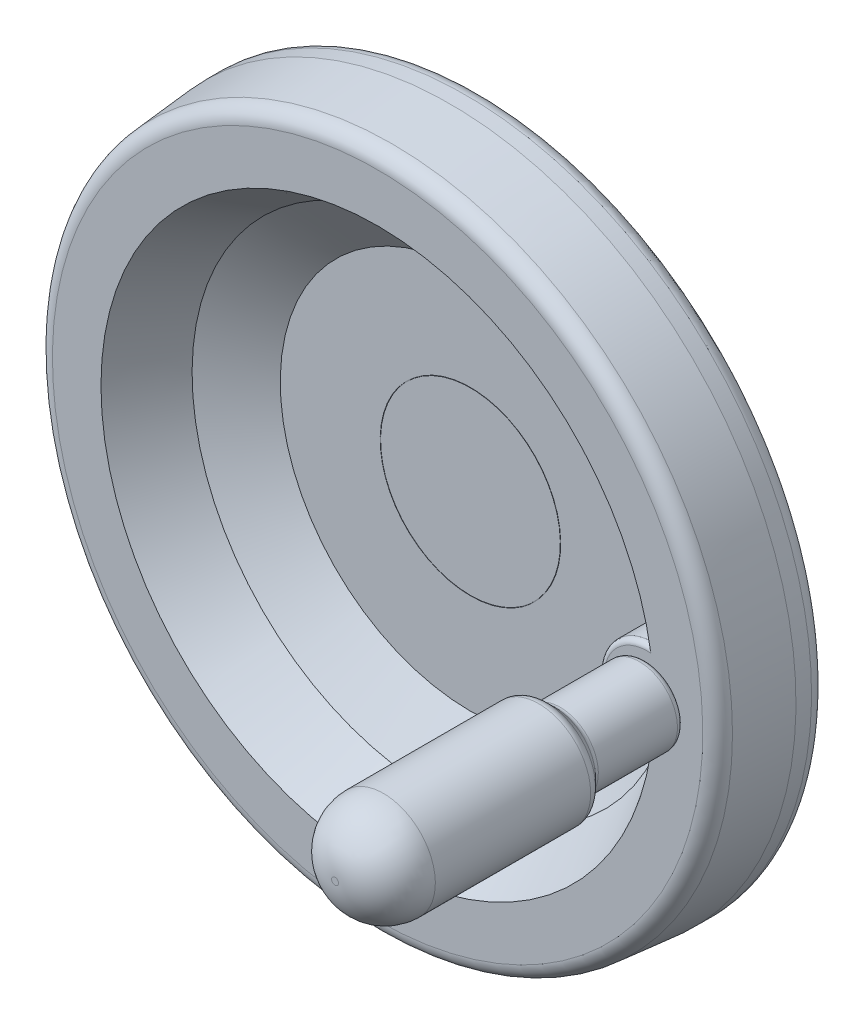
ISO-10303-21;
HEADER;
FILE_DESCRIPTION(('STEP AP214'),'2;1');
FILE_NAME('part.step','',(''),(''),'','','');
FILE_SCHEMA(('AUTOMOTIVE_DESIGN { 1 0 10303 214 1 1 1 1 }'));
ENDSEC;
DATA;
#1=APPLICATION_CONTEXT('core data for automotive mechanical design processes');
#2=APPLICATION_PROTOCOL_DEFINITION('international standard','automotive_design',2000,#1);
#3=PRODUCT_CONTEXT('',#1,'mechanical');
#4=PRODUCT('Part','Part','',(#3));
#5=PRODUCT_RELATED_PRODUCT_CATEGORY('part','',(#4));
#6=PRODUCT_DEFINITION_FORMATION('','',#4);
#7=PRODUCT_DEFINITION_CONTEXT('part definition',#1,'design');
#8=PRODUCT_DEFINITION('design','',#6,#7);
#9=PRODUCT_DEFINITION_SHAPE('','',#8);
#10=(LENGTH_UNIT() NAMED_UNIT(*) SI_UNIT(.MILLI.,.METRE.));
#11=(NAMED_UNIT(*) PLANE_ANGLE_UNIT() SI_UNIT($,.RADIAN.));
#12=(NAMED_UNIT(*) SI_UNIT($,.STERADIAN.) SOLID_ANGLE_UNIT());
#13=UNCERTAINTY_MEASURE_WITH_UNIT(LENGTH_MEASURE(1.E-05),#10,'distance_accuracy_value','');
#14=(GEOMETRIC_REPRESENTATION_CONTEXT(3) GLOBAL_UNCERTAINTY_ASSIGNED_CONTEXT((#13)) GLOBAL_UNIT_ASSIGNED_CONTEXT((#10,
#11,#12)) REPRESENTATION_CONTEXT('',''));
#15=CARTESIAN_POINT('',(0.,0.,0.));
#16=DIRECTION('',(0.,0.,1.));
#17=DIRECTION('',(1.,0.,0.));
#18=AXIS2_PLACEMENT_3D('',#15,#16,#17);
#19=CARTESIAN_POINT('',(80.,0.,68.));
#20=DIRECTION('',(0.,0.,-1.));
#21=DIRECTION('',(0.,1.,0.));
#22=AXIS2_PLACEMENT_3D('',#19,#20,#21);
#23=PLANE('',#22);
#24=CARTESIAN_POINT('',(0.,0.,68.));
#25=DIRECTION('',(0.,0.,1.));
#26=DIRECTION('',(0.,-1.,0.));
#27=AXIS2_PLACEMENT_3D('',#24,#25,#26);
#28=CIRCLE('',#27,94.039247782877);
#29=CARTESIAN_POINT('',(0.,-94.039247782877,68.));
#30=VERTEX_POINT('',#29);
#31=EDGE_CURVE('E54',#30,#30,#28,.T.);
#32=ORIENTED_EDGE('',*,*,#31,.T.);
#33=EDGE_LOOP('',(#32));
#34=FACE_BOUND('',#33,.T.);
#35=CARTESIAN_POINT('',(0.,0.,68.));
#36=DIRECTION('',(0.,0.,1.));
#37=DIRECTION('',(0.,-1.,0.));
#38=AXIS2_PLACEMENT_3D('',#35,#36,#37);
#39=CIRCLE('',#38,80.);
#40=CARTESIAN_POINT('',(79.0240384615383,12.4579831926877,68.));
#41=VERTEX_POINT('',#40);
#42=CARTESIAN_POINT('',(79.0240384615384,-12.4579831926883,68.));
#43=VERTEX_POINT('',#42);
#44=EDGE_CURVE('E49',#41,#43,#39,.T.);
#45=ORIENTED_EDGE('',*,*,#44,.F.);
#46=CARTESIAN_POINT('',(78.,0.,68.));
#47=DIRECTION('',(0.,0.,-1.));
#48=DIRECTION('',(0.,1.,0.));
#49=AXIS2_PLACEMENT_3D('',#46,#47,#48);
#50=CIRCLE('',#49,12.5);
#51=EDGE_CURVE('E52',#43,#41,#50,.T.);
#52=ORIENTED_EDGE('',*,*,#51,.F.);
#53=EDGE_LOOP('',(#45,#52));
#54=FACE_BOUND('',#53,.T.);
#55=CARTESIAN_POINT('',(78.,0.,68.));
#56=DIRECTION('',(0.,0.,-1.));
#57=DIRECTION('',(0.,1.,0.));
#58=AXIS2_PLACEMENT_3D('',#55,#56,#57);
#59=CIRCLE('',#58,5.);
#60=CARTESIAN_POINT('',(78.,5.,68.));
#61=VERTEX_POINT('',#60);
#62=EDGE_CURVE('E9',#61,#61,#59,.F.);
#63=ORIENTED_EDGE('',*,*,#62,.F.);
#64=EDGE_LOOP('',(#63));
#65=FACE_BOUND('',#64,.T.);
#66=ADVANCED_FACE('F14',(#34,#54,#65),#23,.F.);
#67=CARTESIAN_POINT('',(0.,0.,51.653113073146));
#68=DIRECTION('',(0.,0.,1.));
#69=DIRECTION('',(0.,-1.,0.));
#70=AXIS2_PLACEMENT_3D('',#67,#68,#69);
#71=CONICAL_SURFACE('',#70,70.,0.959931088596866);
#72=CARTESIAN_POINT('',(0.,0.,41.15));
#73=DIRECTION('',(0.,0.,1.));
#74=DIRECTION('',(0.,-1.,0.));
#75=AXIS2_PLACEMENT_3D('',#72,#73,#74);
#76=CIRCLE('',#75,55.);
#77=CARTESIAN_POINT('',(0.,-55.,41.15));
#78=VERTEX_POINT('',#77);
#79=EDGE_CURVE('E128',#78,#78,#76,.T.);
#80=ORIENTED_EDGE('',*,*,#79,.F.);
#81=EDGE_LOOP('',(#80));
#82=FACE_BOUND('',#81,.T.);
#83=CARTESIAN_POINT('',(69.1541024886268,10.8512716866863,51.653313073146));
#84=CARTESIAN_POINT('',(68.8683283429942,10.6182944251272,51.4303609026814));
#85=CARTESIAN_POINT('',(68.5897247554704,10.3723980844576,51.2114486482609));
#86=CARTESIAN_POINT('',(68.0487069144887,9.85455601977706,50.7835993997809));
#87=CARTESIAN_POINT('',(67.786314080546,9.58257699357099,50.5746756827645));
#88=CARTESIAN_POINT('',(67.2783513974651,9.01074913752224,50.1677124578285));
#89=CARTESIAN_POINT('',(67.0329280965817,8.71070018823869,49.9697701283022));
#90=CARTESIAN_POINT('',(66.5639008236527,8.08507087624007,49.5892747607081));
#91=CARTESIAN_POINT('',(66.3402855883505,7.75950385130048,49.4067137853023));
#92=CARTESIAN_POINT('',(65.9574377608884,7.14712858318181,49.0924918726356));
#93=CARTESIAN_POINT('',(65.7940045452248,6.86453992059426,48.9577140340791));
#94=CARTESIAN_POINT('',(65.4851042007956,6.28375029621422,48.7019690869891));
#95=CARTESIAN_POINT('',(65.3396332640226,5.98555266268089,48.5809990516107));
#96=CARTESIAN_POINT('',(65.0687698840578,5.37535273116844,48.3549747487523));
#97=CARTESIAN_POINT('',(64.9433267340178,5.06338793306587,48.2498803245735));
#98=CARTESIAN_POINT('',(64.7138679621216,4.42642812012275,48.057084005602));
#99=CARTESIAN_POINT('',(64.6098521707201,4.10143320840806,47.9693819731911));
#100=CARTESIAN_POINT('',(64.424130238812,3.43739326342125,47.8124302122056));
#101=CARTESIAN_POINT('',(64.3426349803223,3.09824753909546,47.7433550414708));
#102=CARTESIAN_POINT('',(64.204766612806,2.41127519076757,47.6263100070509));
#103=CARTESIAN_POINT('',(64.1483937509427,2.06344848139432,47.5783403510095));
#104=CARTESIAN_POINT('',(64.0619516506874,1.36220434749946,47.5047200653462));
#105=CARTESIAN_POINT('',(64.0318811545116,1.00878719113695,47.4790683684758));
#106=CARTESIAN_POINT('',(63.9987137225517,0.29979107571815,47.4507725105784));
#107=CARTESIAN_POINT('',(63.9956132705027,-0.0557875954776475,47.4481253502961));
#108=CARTESIAN_POINT('',(64.0150499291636,-0.718315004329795,47.464709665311));
#109=CARTESIAN_POINT('',(64.0342327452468,-1.02544290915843,47.4810786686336));
#110=CARTESIAN_POINT('',(64.0925772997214,-1.63637634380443,47.5308086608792));
#111=CARTESIAN_POINT('',(64.1317369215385,-1.94018222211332,47.5641678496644));
#112=CARTESIAN_POINT('',(64.2293752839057,-2.54221462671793,47.6472050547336));
#113=CARTESIAN_POINT('',(64.287843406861,-2.84044412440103,47.696874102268));
#114=CARTESIAN_POINT('',(64.42322329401,-3.42965311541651,47.8116298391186));
#115=CARTESIAN_POINT('',(64.5001358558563,-3.72063229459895,47.876717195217));
#116=CARTESIAN_POINT('',(64.6716746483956,-4.29486830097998,48.0214984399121));
#117=CARTESIAN_POINT('',(64.7663682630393,-4.57809089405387,48.1012478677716));
#118=CARTESIAN_POINT('',(64.9721330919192,-5.13446226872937,48.2740065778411));
#119=CARTESIAN_POINT('',(65.0832105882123,-5.40760713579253,48.3670209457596));
#120=CARTESIAN_POINT('',(65.3207417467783,-5.94326702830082,48.5652387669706));
#121=CARTESIAN_POINT('',(65.4472260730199,-6.20575942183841,48.6704665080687));
#122=CARTESIAN_POINT('',(65.7141923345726,-6.71882430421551,48.8917269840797));
#123=CARTESIAN_POINT('',(65.8546771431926,-6.96939433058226,49.0077619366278));
#124=CARTESIAN_POINT('',(66.2180479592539,-7.57377249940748,49.3066693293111));
#125=CARTESIAN_POINT('',(66.4484616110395,-7.92030587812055,49.4951805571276));
#126=CARTESIAN_POINT('',(66.9338251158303,-8.5854218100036,49.8896579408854));
#127=CARTESIAN_POINT('',(67.1887942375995,-8.90398203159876,50.0956377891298));
#128=CARTESIAN_POINT('',(67.7186017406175,-9.51074196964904,50.5206650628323));
#129=CARTESIAN_POINT('',(67.9933240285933,-9.79909796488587,50.7396349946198));
#130=CARTESIAN_POINT('',(68.5607784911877,-10.3467967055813,51.1887018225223));
#131=CARTESIAN_POINT('',(68.8534793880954,-10.6061877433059,51.4187792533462));
#132=CARTESIAN_POINT('',(69.1541024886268,-10.8512716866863,51.653313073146));
#133=B_SPLINE_CURVE_WITH_KNOTS('',3,(#83,#84,#85,#86,#87,#88,#89,#90,#91,#92,#93,#94,#95,#96,
#97,#98,#99,#100,#101,#102,#103,#104,#105,#106,#107,#108,#109,#110,#111,#112,#113,#114,#115,
#116,#117,#118,#119,#120,#121,#122,#123,#124,#125,#126,#127,#128,#129,#130,#131,#132),
.UNSPECIFIED.,.F.,.F.,(4,2,2,2,2,2,2,2,2,2,2,2,2,2,2,2,2,2,2,2,2,2,2,2,4),(0.,1.29256155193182,
2.58679598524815,3.8910861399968,5.19469905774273,6.25324224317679,7.3115606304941,
8.36715552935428,9.42274207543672,10.4879017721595,11.553071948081,12.6181911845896,
13.6831715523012,14.6065377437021,15.5298061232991,16.4525676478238,17.375369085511,
18.3017409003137,19.2284688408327,20.1570723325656,21.0858667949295,22.4543043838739,
23.8238246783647,25.1858670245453,26.5456034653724),.UNSPECIFIED.);
#134=CARTESIAN_POINT('',(69.1538461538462,10.8510627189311,51.653113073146));
#135=VERTEX_POINT('',#134);
#136=CARTESIAN_POINT('',(69.1538461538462,-10.8510627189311,51.653113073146));
#137=VERTEX_POINT('',#136);
#138=EDGE_CURVE('E185',#135,#137,#133,.T.);
#139=ORIENTED_EDGE('',*,*,#138,.F.);
#140=CARTESIAN_POINT('',(0.,0.,51.653113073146));
#141=DIRECTION('',(0.,0.,1.));
#142=DIRECTION('',(0.,-1.,0.));
#143=AXIS2_PLACEMENT_3D('',#140,#141,#142);
#144=CIRCLE('',#143,70.);
#145=EDGE_CURVE('E53',#135,#137,#144,.T.);
#146=ORIENTED_EDGE('',*,*,#145,.T.);
#147=EDGE_LOOP('',(#139,#146));
#148=FACE_BOUND('',#147,.T.);
#149=ADVANCED_FACE('F190',(#82,#148),#71,.F.);
#150=CARTESIAN_POINT('',(0.,0.,68.));
#151=DIRECTION('',(0.,0.,1.));
#152=DIRECTION('',(0.,-1.,0.));
#153=AXIS2_PLACEMENT_3D('',#150,#151,#152);
#154=CONICAL_SURFACE('',#153,80.,0.549005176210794);
#155=CARTESIAN_POINT('',(69.1537363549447,-10.8509732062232,51.652913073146));
#156=CARTESIAN_POINT('',(69.2875304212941,-10.9600415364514,51.8966214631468));
#157=CARTESIAN_POINT('',(69.4222737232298,-11.0657801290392,52.1412788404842));
#158=CARTESIAN_POINT('',(69.6935510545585,-11.2708406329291,52.6322650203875));
#159=CARTESIAN_POINT('',(69.8300849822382,-11.3701629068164,52.8785937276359));
#160=CARTESIAN_POINT('',(70.2421515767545,-11.6588295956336,53.619640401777));
#161=CARTESIAN_POINT('',(70.5202294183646,-11.8389389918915,54.116565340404));
#162=CARTESIAN_POINT('',(71.0823376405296,-12.1759298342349,55.1146122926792));
#163=CARTESIAN_POINT('',(71.3663659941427,-12.3328190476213,55.6157328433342));
#164=CARTESIAN_POINT('',(71.9399403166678,-12.6245474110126,56.6212651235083));
#165=CARTESIAN_POINT('',(72.2294866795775,-12.759384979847,57.1256770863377));
#166=CARTESIAN_POINT('',(72.8099260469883,-13.0062033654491,58.1304601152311));
#167=CARTESIAN_POINT('',(73.1007563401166,-13.118450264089,58.6308022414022));
#168=CARTESIAN_POINT('',(73.6869121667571,-13.322672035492,59.6329902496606));
#169=CARTESIAN_POINT('',(73.9822377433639,-13.4146467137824,60.1348361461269));
#170=CARTESIAN_POINT('',(74.576943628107,-13.5785786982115,61.139241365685));
#171=CARTESIAN_POINT('',(74.8763230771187,-13.6505401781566,61.6418005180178));
#172=CARTESIAN_POINT('',(75.478821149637,-13.7745505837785,62.6470870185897));
#173=CARTESIAN_POINT('',(75.781939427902,-13.826601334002,63.1498143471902));
#174=CARTESIAN_POINT('',(76.2306987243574,-13.8885088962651,63.8896531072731));
#175=CARTESIAN_POINT('',(76.3750295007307,-13.9061368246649,64.1269329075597));
#176=CARTESIAN_POINT('',(76.6643888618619,-13.9369046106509,64.6013088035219));
#177=CARTESIAN_POINT('',(76.8094173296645,-13.9500451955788,64.838404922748));
#178=CARTESIAN_POINT('',(77.1005887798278,-13.9718445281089,65.3130960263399));
#179=CARTESIAN_POINT('',(77.2467337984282,-13.9804897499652,65.5506903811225));
#180=CARTESIAN_POINT('',(77.5396915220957,-13.9931985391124,66.0256459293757));
#181=CARTESIAN_POINT('',(77.6865043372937,-13.9972613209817,66.2630070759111));
#182=CARTESIAN_POINT('',(77.8336179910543,-13.9990112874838,66.5002));
#183=B_SPLINE_CURVE_WITH_KNOTS('',3,(#155,#156,#157,#158,#159,#160,#161,#162,#163,#164,#165,
#166,#167,#168,#169,#170,#171,#172,#173,#174,#175,#176,#177,#178,#179,#180,#181,#182),
.UNSPECIFIED.,.F.,.F.,(4,2,2,2,2,2,2,2,2,2,2,2,2,4),(0.,0.895893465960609,1.79173626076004,
3.58288453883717,5.3734323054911,7.16410840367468,8.93226857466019,10.7004457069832,
12.4682538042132,14.2358998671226,15.0707322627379,15.9054292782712,16.7426234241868,
17.5799610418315),.UNSPECIFIED.);
#184=CARTESIAN_POINT('',(77.8334939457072,-13.9990098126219,66.5));
#185=VERTEX_POINT('',#184);
#186=EDGE_CURVE('E22',#137,#185,#183,.T.);
#187=ORIENTED_EDGE('',*,*,#186,.F.);
#188=ORIENTED_EDGE('',*,*,#145,.F.);
#189=CARTESIAN_POINT('',(77.8336179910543,13.9990112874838,66.5002));
#190=CARTESIAN_POINT('',(77.5200782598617,13.995254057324,65.9946810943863));
#191=CARTESIAN_POINT('',(77.207911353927,13.981038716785,65.4884004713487));
#192=CARTESIAN_POINT('',(76.5867046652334,13.931974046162,64.474913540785));
#193=CARTESIAN_POINT('',(76.277664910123,13.8971245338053,63.9677072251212));
#194=CARTESIAN_POINT('',(75.662691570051,13.8070140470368,62.9523019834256));
#195=CARTESIAN_POINT('',(75.356762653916,13.7517260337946,62.4441026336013));
#196=CARTESIAN_POINT('',(74.7487979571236,13.6208073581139,61.4279991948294));
#197=CARTESIAN_POINT('',(74.446762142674,13.5451768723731,60.9200951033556));
#198=CARTESIAN_POINT('',(73.851206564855,13.3746807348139,59.9124225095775));
#199=CARTESIAN_POINT('',(73.5576267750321,13.2801030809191,59.4126407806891));
#200=CARTESIAN_POINT('',(72.974984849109,13.0707708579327,58.4146740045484));
#201=CARTESIAN_POINT('',(72.6859226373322,12.9560166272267,57.9164889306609));
#202=CARTESIAN_POINT('',(72.1129173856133,12.7059009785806,56.9228275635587));
#203=CARTESIAN_POINT('',(71.8289709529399,12.5705538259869,56.4273496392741));
#204=CARTESIAN_POINT('',(71.2664794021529,12.2784420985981,55.4397093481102));
#205=CARTESIAN_POINT('',(70.9879335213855,12.1216805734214,54.9475465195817));
#206=CARTESIAN_POINT('',(70.5797400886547,11.8728195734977,54.2218055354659));
#207=CARTESIAN_POINT('',(70.4478064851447,11.7893599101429,53.9865244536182));
#208=CARTESIAN_POINT('',(70.1853928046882,11.6170801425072,53.5171439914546));
#209=CARTESIAN_POINT('',(70.0549125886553,11.5282605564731,53.2830444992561));
#210=CARTESIAN_POINT('',(69.79503290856,11.3447746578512,52.8153783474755));
#211=CARTESIAN_POINT('',(69.6656386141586,11.2500895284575,52.5818161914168));
#212=CARTESIAN_POINT('',(69.4084555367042,11.0549258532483,52.1161867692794));
#213=CARTESIAN_POINT('',(69.2806669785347,10.9544465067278,51.8841197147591));
#214=CARTESIAN_POINT('',(69.1537363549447,10.8509732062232,51.652913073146));
#215=B_SPLINE_CURVE_WITH_KNOTS('',3,(#189,#190,#191,#192,#193,#194,#195,#196,#197,#198,#199,
#200,#201,#202,#203,#204,#205,#206,#207,#208,#209,#210,#211,#212,#213,#214),.UNSPECIFIED.,.F.,
.F.,(4,2,2,2,2,2,2,2,2,2,2,2,4),(0.,1.78450175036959,3.56901926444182,5.35590607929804,
7.14277737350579,8.90430781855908,10.6658087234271,12.4260948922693,14.1861306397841,
15.0331751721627,15.8801379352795,16.7299746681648,17.5799291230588),.UNSPECIFIED.);
#216=CARTESIAN_POINT('',(77.8334939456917,13.9990098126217,66.4999999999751));
#217=VERTEX_POINT('',#216);
#218=EDGE_CURVE('E36',#217,#135,#215,.T.);
#219=ORIENTED_EDGE('',*,*,#218,.F.);
#220=CARTESIAN_POINT('',(78.3141391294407,10.9955134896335,66.4998));
#221=CARTESIAN_POINT('',(78.3811257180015,10.9935877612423,66.607822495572));
#222=CARTESIAN_POINT('',(78.447461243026,11.0027621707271,66.7172768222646));
#223=CARTESIAN_POINT('',(78.57596755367,11.0452558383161,66.9349503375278));
#224=CARTESIAN_POINT('',(78.6381036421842,11.0787544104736,67.0431542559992));
#225=CARTESIAN_POINT('',(78.7349362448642,11.1564311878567,67.2176644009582));
#226=CARTESIAN_POINT('',(78.7718857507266,11.1933522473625,67.2859365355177));
#227=CARTESIAN_POINT('',(78.8407238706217,11.2791335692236,67.4171314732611));
#228=CARTESIAN_POINT('',(78.8726266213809,11.3279594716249,67.4800689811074));
#229=CARTESIAN_POINT('',(78.9301977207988,11.4379062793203,67.5988786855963));
#230=CARTESIAN_POINT('',(78.9558045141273,11.4991386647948,67.6546787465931));
#231=CARTESIAN_POINT('',(78.9987553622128,11.6323585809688,67.7557046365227));
#232=CARTESIAN_POINT('',(79.0161036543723,11.7043405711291,67.8009358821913));
#233=CARTESIAN_POINT('',(79.0395661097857,11.8458322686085,67.8729717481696));
#234=CARTESIAN_POINT('',(79.0469109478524,11.9142829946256,67.9014676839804));
#235=CARTESIAN_POINT('',(79.0542826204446,12.0550396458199,67.9478719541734));
#236=CARTESIAN_POINT('',(79.054312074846,12.1273441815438,67.965784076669));
#237=CARTESIAN_POINT('',(79.0474258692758,12.2690312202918,67.9899869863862));
#238=CARTESIAN_POINT('',(79.0409266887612,12.3383288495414,67.9969104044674));
#239=CARTESIAN_POINT('',(79.0220507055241,12.4764055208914,68.0014337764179));
#240=CARTESIAN_POINT('',(79.0096730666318,12.5451844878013,67.9990324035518));
#241=CARTESIAN_POINT('',(78.9786720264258,12.6851386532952,67.9850614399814));
#242=CARTESIAN_POINT('',(78.9596915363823,12.7561741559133,67.9728995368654));
#243=CARTESIAN_POINT('',(78.9165975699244,12.8944737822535,67.9396218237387));
#244=CARTESIAN_POINT('',(78.892481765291,12.9617361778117,67.9185019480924));
#245=CARTESIAN_POINT('',(78.8364032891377,13.1001645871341,67.8649335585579));
#246=CARTESIAN_POINT('',(78.8038212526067,13.1706365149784,67.8313424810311));
#247=CARTESIAN_POINT('',(78.7342348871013,13.3042512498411,67.7553616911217));
#248=CARTESIAN_POINT('',(78.6972283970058,13.3673904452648,67.7129676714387));
#249=CARTESIAN_POINT('',(78.6139524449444,13.4944613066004,67.6137293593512));
#250=CARTESIAN_POINT('',(78.5671271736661,13.5570815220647,67.5556704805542));
#251=CARTESIAN_POINT('',(78.4702722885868,13.6707230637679,67.4314059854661));
#252=CARTESIAN_POINT('',(78.4202402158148,13.7217353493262,67.3651940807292));
#253=CARTESIAN_POINT('',(78.3120424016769,13.8168508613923,67.217892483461));
#254=CARTESIAN_POINT('',(78.2536229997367,13.8593809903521,67.1359714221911));
#255=CARTESIAN_POINT('',(78.135920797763,13.9280959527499,66.9661826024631));
#256=CARTESIAN_POINT('',(78.0766387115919,13.9542935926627,66.8783195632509));
#257=CARTESIAN_POINT('',(77.9866330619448,13.9812850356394,66.7412707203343));
#258=CARTESIAN_POINT('',(77.9556367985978,13.9882330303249,66.6934034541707));
#259=CARTESIAN_POINT('',(77.8941134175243,13.9972722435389,66.5970269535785));
#260=CARTESIAN_POINT('',(77.8635856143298,13.9993714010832,66.548518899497));
#261=CARTESIAN_POINT('',(77.833369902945,13.9990083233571,66.4998));
#262=B_SPLINE_CURVE_WITH_KNOTS('',3,(#220,#221,#222,#223,#224,#225,#226,#227,#228,#229,#230,
#231,#232,#233,#234,#235,#236,#237,#238,#239,#240,#241,#242,#243,#244,#245,#246,#247,#248,#249,
#250,#251,#252,#253,#254,#255,#256,#257,#258,#259,#260,#261),.UNSPECIFIED.,.F.,.F.,(4,2,2,2,2,2,
2,2,2,2,2,2,2,2,2,2,2,2,2,2,4),(0.,0.382055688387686,0.766956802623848,1.02384686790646,
1.28000409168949,1.53857417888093,1.79701145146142,2.01935159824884,2.24161211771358,
2.4505408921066,2.65949939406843,2.88219416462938,3.10499011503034,3.35778866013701,
3.61071119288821,3.90170688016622,4.19292843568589,4.51923983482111,4.84529504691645,
5.0174543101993,5.1893314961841),.UNSPECIFIED.);
#263=EDGE_CURVE('E56',#41,#217,#262,.T.);
#264=ORIENTED_EDGE('',*,*,#263,.F.);
#265=ORIENTED_EDGE('',*,*,#44,.T.);
#266=CARTESIAN_POINT('',(77.833369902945,-13.9990083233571,66.4998));
#267=CARTESIAN_POINT('',(77.9008934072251,-13.9998574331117,66.6086977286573));
#268=CARTESIAN_POINT('',(77.9700341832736,-13.9883259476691,66.7165879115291));
#269=CARTESIAN_POINT('',(78.1089423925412,-13.9417812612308,66.9266985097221));
#270=CARTESIAN_POINT('',(78.1787095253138,-13.9067787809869,67.0289214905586));
#271=CARTESIAN_POINT('',(78.3087814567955,-13.819627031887,67.2134421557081));
#272=CARTESIAN_POINT('',(78.3692847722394,-13.7697796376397,67.2966955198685));
#273=CARTESIAN_POINT('',(78.4869663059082,-13.6534535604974,67.4534451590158));
#274=CARTESIAN_POINT('',(78.5441445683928,-13.5869750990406,67.5269415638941));
#275=CARTESIAN_POINT('',(78.6522090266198,-13.439853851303,67.6602904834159));
#276=CARTESIAN_POINT('',(78.7031837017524,-13.3594637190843,67.720348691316));
#277=CARTESIAN_POINT('',(78.797622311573,-13.1854728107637,67.8253115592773));
#278=CARTESIAN_POINT('',(78.8410985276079,-13.0918941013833,67.8702411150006));
#279=CARTESIAN_POINT('',(78.9076155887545,-12.9207681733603,67.9320637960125));
#280=CARTESIAN_POINT('',(78.9330084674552,-12.8456694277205,67.9532463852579));
#281=CARTESIAN_POINT('',(78.9772926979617,-12.6913147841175,67.9844276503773));
#282=CARTESIAN_POINT('',(78.9961879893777,-12.6120614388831,67.9944331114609));
#283=CARTESIAN_POINT('',(79.0264787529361,-12.450961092,68.0020844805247));
#284=CARTESIAN_POINT('',(79.0378251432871,-12.3691006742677,67.99965037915));
#285=CARTESIAN_POINT('',(79.051902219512,-12.2061126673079,67.981463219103));
#286=CARTESIAN_POINT('',(79.054639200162,-12.124984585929,67.965719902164));
#287=CARTESIAN_POINT('',(79.0513120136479,-11.97571303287,67.9235849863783));
#288=CARTESIAN_POINT('',(79.0462158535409,-11.9071438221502,67.8986123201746));
#289=CARTESIAN_POINT('',(79.0291393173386,-11.7752529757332,67.8390614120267));
#290=CARTESIAN_POINT('',(79.017160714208,-11.7119299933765,67.8044856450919));
#291=CARTESIAN_POINT('',(78.987550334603,-11.5947784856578,67.7286564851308));
#292=CARTESIAN_POINT('',(78.9701742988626,-11.5406646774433,67.687740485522));
#293=CARTESIAN_POINT('',(78.9304278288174,-11.4398522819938,67.599710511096));
#294=CARTESIAN_POINT('',(78.9080564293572,-11.3931551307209,67.5525953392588));
#295=CARTESIAN_POINT('',(78.8571801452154,-11.3041558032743,67.4495557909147));
#296=CARTESIAN_POINT('',(78.8283226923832,-11.2625282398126,67.3932258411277));
#297=CARTESIAN_POINT('',(78.7668295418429,-11.1885926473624,67.2766625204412));
#298=CARTESIAN_POINT('',(78.7341913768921,-11.1562907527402,67.2164266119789));
#299=CARTESIAN_POINT('',(78.6601757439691,-11.0959778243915,67.0828217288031));
#300=CARTESIAN_POINT('',(78.6182626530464,-11.0696725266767,67.0089818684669));
#301=CARTESIAN_POINT('',(78.5317616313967,-11.0289401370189,66.8596848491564));
#302=CARTESIAN_POINT('',(78.4871733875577,-11.0145144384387,66.7842275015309));
#303=CARTESIAN_POINT('',(78.3998087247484,-10.9976142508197,66.6389622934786));
#304=CARTESIAN_POINT('',(78.357163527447,-10.9942929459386,66.5691743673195));
#305=CARTESIAN_POINT('',(78.3141391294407,-10.9955134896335,66.4998));
#306=B_SPLINE_CURVE_WITH_KNOTS('',3,(#266,#267,#268,#269,#270,#271,#272,#273,#274,#275,#276,
#277,#278,#279,#280,#281,#282,#283,#284,#285,#286,#287,#288,#289,#290,#291,#292,#293,#294,#295,
#296,#297,#298,#299,#300,#301,#302,#303,#304,#305),.UNSPECIFIED.,.F.,.F.,(4,2,2,2,2,2,2,2,2,2,2,
2,2,2,2,2,2,2,2,4),(0.,0.383722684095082,0.767270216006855,1.10874800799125,1.45022125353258,
1.78604257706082,2.12130854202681,2.3664906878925,2.61152391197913,2.85813512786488,
3.10456599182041,3.32289632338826,3.54117043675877,3.75036963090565,3.95960927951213,
4.18601062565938,4.41256055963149,4.67825459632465,4.94397979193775,5.18891300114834),.UNSPECIFIED.);
#307=EDGE_CURVE('E29',#185,#43,#306,.T.);
#308=ORIENTED_EDGE('',*,*,#307,.F.);
#309=EDGE_LOOP('',(#187,#188,#219,#264,#265,#308));
#310=FACE_BOUND('',#309,.T.);
#311=ADVANCED_FACE('F57',(#310),#154,.F.);
#312=CARTESIAN_POINT('',(0.,0.,41.15));
#313=DIRECTION('',(0.,0.,-1.));
#314=DIRECTION('',(0.,1.,0.));
#315=AXIS2_PLACEMENT_3D('',#312,#313,#314);
#316=PLANE('',#315);
#317=CARTESIAN_POINT('',(0.,0.,41.15));
#318=DIRECTION('',(0.,0.,1.));
#319=DIRECTION('',(0.,-1.,0.));
#320=AXIS2_PLACEMENT_3D('',#317,#318,#319);
#321=CIRCLE('',#320,26.);
#322=CARTESIAN_POINT('',(0.,-26.,41.15));
#323=VERTEX_POINT('',#322);
#324=EDGE_CURVE('E114',#323,#323,#321,.T.);
#325=ORIENTED_EDGE('',*,*,#324,.T.);
#326=EDGE_LOOP('',(#325));
#327=FACE_BOUND('',#326,.T.);
#328=ADVANCED_FACE('F16',(#327),#316,.F.);
#329=CARTESIAN_POINT('',(0.,0.,40.));
#330=DIRECTION('',(0.,0.,1.));
#331=DIRECTION('',(0.,-1.,0.));
#332=AXIS2_PLACEMENT_3D('',#329,#330,#331);
#333=CYLINDRICAL_SURFACE('',#332,26.);
#334=ORIENTED_EDGE('',*,*,#324,.F.);
#335=EDGE_LOOP('',(#334));
#336=FACE_BOUND('',#335,.T.);
#337=CARTESIAN_POINT('',(0.,0.,40.9));
#338=DIRECTION('',(0.,0.,1.));
#339=DIRECTION('',(0.,-1.,0.));
#340=AXIS2_PLACEMENT_3D('',#337,#338,#339);
#341=CIRCLE('',#340,26.);
#342=CARTESIAN_POINT('',(0.,-26.,40.9));
#343=VERTEX_POINT('',#342);
#344=EDGE_CURVE('E116',#343,#343,#341,.T.);
#345=ORIENTED_EDGE('',*,*,#344,.T.);
#346=EDGE_LOOP('',(#345));
#347=FACE_BOUND('',#346,.T.);
#348=ADVANCED_FACE('F206',(#336,#347),#333,.T.);
#349=CARTESIAN_POINT('',(26.,0.,40.9));
#350=DIRECTION('',(0.,0.,-1.));
#351=DIRECTION('',(0.,1.,0.));
#352=AXIS2_PLACEMENT_3D('',#349,#350,#351);
#353=PLANE('',#352);
#354=ORIENTED_EDGE('',*,*,#344,.F.);
#355=EDGE_LOOP('',(#354));
#356=FACE_BOUND('',#355,.T.);
#357=CARTESIAN_POINT('',(0.,0.,40.9));
#358=DIRECTION('',(0.,0.,1.));
#359=DIRECTION('',(0.,-1.,0.));
#360=AXIS2_PLACEMENT_3D('',#357,#358,#359);
#361=CIRCLE('',#360,26.1);
#362=CARTESIAN_POINT('',(0.,-26.1,40.9));
#363=VERTEX_POINT('',#362);
#364=EDGE_CURVE('E120',#363,#363,#361,.T.);
#365=ORIENTED_EDGE('',*,*,#364,.T.);
#366=EDGE_LOOP('',(#365));
#367=FACE_BOUND('',#366,.T.);
#368=ADVANCED_FACE('F203',(#356,#367),#353,.F.);
#369=CARTESIAN_POINT('',(0.,0.,40.));
#370=DIRECTION('',(0.,0.,1.));
#371=DIRECTION('',(0.,-1.,0.));
#372=AXIS2_PLACEMENT_3D('',#369,#370,#371);
#373=CYLINDRICAL_SURFACE('',#372,26.1);
#374=ORIENTED_EDGE('',*,*,#364,.F.);
#375=EDGE_LOOP('',(#374));
#376=FACE_BOUND('',#375,.T.);
#377=CARTESIAN_POINT('',(0.,0.,41.15));
#378=DIRECTION('',(0.,0.,1.));
#379=DIRECTION('',(0.,-1.,0.));
#380=AXIS2_PLACEMENT_3D('',#377,#378,#379);
#381=CIRCLE('',#380,26.1);
#382=CARTESIAN_POINT('',(0.,-26.1,41.15));
#383=VERTEX_POINT('',#382);
#384=EDGE_CURVE('E125',#383,#383,#381,.T.);
#385=ORIENTED_EDGE('',*,*,#384,.T.);
#386=EDGE_LOOP('',(#385));
#387=FACE_BOUND('',#386,.T.);
#388=ADVANCED_FACE('F199',(#376,#387),#373,.F.);
#389=CARTESIAN_POINT('',(26.1,0.,41.15));
#390=DIRECTION('',(0.,0.,-1.));
#391=DIRECTION('',(0.,1.,0.));
#392=AXIS2_PLACEMENT_3D('',#389,#390,#391);
#393=PLANE('',#392);
#394=ORIENTED_EDGE('',*,*,#384,.F.);
#395=EDGE_LOOP('',(#394));
#396=FACE_BOUND('',#395,.T.);
#397=ORIENTED_EDGE('',*,*,#79,.T.);
#398=EDGE_LOOP('',(#397));
#399=FACE_BOUND('',#398,.T.);
#400=ADVANCED_FACE('F195',(#396,#399),#393,.F.);
#401=CARTESIAN_POINT('',(0.,0.,63.5000000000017));
#402=DIRECTION('',(0.,0.,1.));
#403=DIRECTION('',(0.,-1.,0.));
#404=AXIS2_PLACEMENT_3D('',#401,#402,#403);
#405=TOROIDAL_SURFACE('',#404,94.0392477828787,4.4999999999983);
#406=ORIENTED_EDGE('',*,*,#31,.F.);
#407=EDGE_LOOP('',(#406));
#408=FACE_BOUND('',#407,.T.);
#409=CARTESIAN_POINT('',(0.,0.,63.892200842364));
#410=DIRECTION('',(0.,0.,1.));
#411=DIRECTION('',(0.,-1.,0.));
#412=AXIS2_PLACEMENT_3D('',#409,#410,#411);
#413=CIRCLE('',#412,98.52212392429);
#414=CARTESIAN_POINT('',(0.,-98.52212392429,63.892200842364));
#415=VERTEX_POINT('',#414);
#416=EDGE_CURVE('E135',#415,#415,#413,.T.);
#417=ORIENTED_EDGE('',*,*,#416,.T.);
#418=EDGE_LOOP('',(#417));
#419=FACE_BOUND('',#418,.T.);
#420=ADVANCED_FACE('F198',(#408,#419),#405,.T.);
#421=CARTESIAN_POINT('',(0.,0.,47.));
#422=DIRECTION('',(0.,0.,-1.));
#423=DIRECTION('',(0.,1.,0.));
#424=AXIS2_PLACEMENT_3D('',#421,#422,#423);
#425=CONICAL_SURFACE('',#424,100.,0.0872664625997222);
#426=ORIENTED_EDGE('',*,*,#416,.F.);
#427=EDGE_LOOP('',(#426));
#428=FACE_BOUND('',#427,.T.);
#429=CARTESIAN_POINT('',(0.,0.,47.));
#430=DIRECTION('',(0.,0.,1.));
#431=DIRECTION('',(0.,-1.,0.));
#432=AXIS2_PLACEMENT_3D('',#429,#430,#431);
#433=CIRCLE('',#432,100.);
#434=CARTESIAN_POINT('',(0.,-100.,47.));
#435=VERTEX_POINT('',#434);
#436=EDGE_CURVE('E138',#435,#435,#433,.T.);
#437=ORIENTED_EDGE('',*,*,#436,.T.);
#438=EDGE_LOOP('',(#437));
#439=FACE_BOUND('',#438,.T.);
#440=ADVANCED_FACE('F224',(#428,#439),#425,.T.);
#441=CARTESIAN_POINT('',(0.,0.,40.));
#442=DIRECTION('',(0.,0.,1.));
#443=DIRECTION('',(0.,-1.,0.));
#444=AXIS2_PLACEMENT_3D('',#441,#442,#443);
#445=CYLINDRICAL_SURFACE('',#444,100.);
#446=ORIENTED_EDGE('',*,*,#436,.F.);
#447=EDGE_LOOP('',(#446));
#448=FACE_BOUND('',#447,.T.);
#449=CARTESIAN_POINT('',(0.,0.,42.5));
#450=DIRECTION('',(0.,0.,1.));
#451=DIRECTION('',(0.,-1.,0.));
#452=AXIS2_PLACEMENT_3D('',#449,#450,#451);
#453=CIRCLE('',#452,100.);
#454=CARTESIAN_POINT('',(0.,-100.,42.5));
#455=VERTEX_POINT('',#454);
#456=EDGE_CURVE('E141',#455,#455,#453,.T.);
#457=ORIENTED_EDGE('',*,*,#456,.T.);
#458=EDGE_LOOP('',(#457));
#459=FACE_BOUND('',#458,.T.);
#460=ADVANCED_FACE('F228',(#448,#459),#445,.T.);
#461=CARTESIAN_POINT('',(0.,0.,42.5000000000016));
#462=DIRECTION('',(0.,0.,1.));
#463=DIRECTION('',(0.,-1.,0.));
#464=AXIS2_PLACEMENT_3D('',#461,#462,#463);
#465=TOROIDAL_SURFACE('',#464,95.4999999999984,4.5000000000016);
#466=ORIENTED_EDGE('',*,*,#456,.F.);
#467=EDGE_LOOP('',(#466));
#468=FACE_BOUND('',#467,.T.);
#469=CARTESIAN_POINT('',(0.,0.,38.));
#470=DIRECTION('',(0.,0.,1.));
#471=DIRECTION('',(0.,-1.,0.));
#472=AXIS2_PLACEMENT_3D('',#469,#470,#471);
#473=CIRCLE('',#472,95.5);
#474=CARTESIAN_POINT('',(0.,-95.5,38.));
#475=VERTEX_POINT('',#474);
#476=EDGE_CURVE('E144',#475,#475,#473,.T.);
#477=ORIENTED_EDGE('',*,*,#476,.T.);
#478=EDGE_LOOP('',(#477));
#479=FACE_BOUND('',#478,.T.);
#480=ADVANCED_FACE('F232',(#468,#479),#465,.T.);
#481=CARTESIAN_POINT('',(95.5,0.,38.));
#482=DIRECTION('',(0.,0.,1.));
#483=DIRECTION('',(0.,-1.,0.));
#484=AXIS2_PLACEMENT_3D('',#481,#482,#483);
#485=PLANE('',#484);
#486=ORIENTED_EDGE('',*,*,#476,.F.);
#487=EDGE_LOOP('',(#486));
#488=FACE_BOUND('',#487,.T.);
#489=CARTESIAN_POINT('',(0.,0.,38.));
#490=DIRECTION('',(0.,0.,1.));
#491=DIRECTION('',(0.,-1.,0.));
#492=AXIS2_PLACEMENT_3D('',#489,#490,#491);
#493=CIRCLE('',#492,70.579283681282);
#494=CARTESIAN_POINT('',(0.,-70.579283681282,38.));
#495=VERTEX_POINT('',#494);
#496=EDGE_CURVE('E147',#495,#495,#493,.T.);
#497=ORIENTED_EDGE('',*,*,#496,.T.);
#498=EDGE_LOOP('',(#497));
#499=FACE_BOUND('',#498,.T.);
#500=ADVANCED_FACE('F236',(#488,#499),#485,.F.);
#501=CARTESIAN_POINT('',(0.,0.,33.5000000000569));
#502=DIRECTION('',(0.,0.,1.));
#503=DIRECTION('',(0.,-1.,0.));
#504=AXIS2_PLACEMENT_3D('',#501,#502,#503);
#505=TOROIDAL_SURFACE('',#504,70.5792836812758,4.49999999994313);
#506=ORIENTED_EDGE('',*,*,#496,.F.);
#507=EDGE_LOOP('',(#506));
#508=FACE_BOUND('',#507,.T.);
#509=CARTESIAN_POINT('',(0.,0.,37.853289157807));
#510=DIRECTION('',(0.,0.,1.));
#511=DIRECTION('',(0.,-1.,0.));
#512=AXIS2_PLACEMENT_3D('',#509,#510,#511);
#513=CIRCLE('',#512,69.43960236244);
#514=CARTESIAN_POINT('',(0.,-69.43960236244,37.853289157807));
#515=VERTEX_POINT('',#514);
#516=EDGE_CURVE('E150',#515,#515,#513,.T.);
#517=ORIENTED_EDGE('',*,*,#516,.T.);
#518=EDGE_LOOP('',(#517));
#519=FACE_BOUND('',#518,.T.);
#520=ADVANCED_FACE('F240',(#508,#519),#505,.F.);
#521=CARTESIAN_POINT('',(0.,0.,27.229723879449));
#522=DIRECTION('',(0.,0.,1.));
#523=DIRECTION('',(0.,-1.,0.));
#524=AXIS2_PLACEMENT_3D('',#521,#522,#523);
#525=CONICAL_SURFACE('',#524,28.860318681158,1.31474508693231);
#526=ORIENTED_EDGE('',*,*,#516,.F.);
#527=EDGE_LOOP('',(#526));
#528=FACE_BOUND('',#527,.T.);
#529=CARTESIAN_POINT('',(0.,0.,27.229723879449));
#530=DIRECTION('',(0.,0.,1.));
#531=DIRECTION('',(0.,-1.,0.));
#532=AXIS2_PLACEMENT_3D('',#529,#530,#531);
#533=CIRCLE('',#532,28.860318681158);
#534=CARTESIAN_POINT('',(0.,-28.860318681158,27.229723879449));
#535=VERTEX_POINT('',#534);
#536=EDGE_CURVE('E153',#535,#535,#533,.T.);
#537=ORIENTED_EDGE('',*,*,#536,.T.);
#538=EDGE_LOOP('',(#537));
#539=FACE_BOUND('',#538,.T.);
#540=ADVANCED_FACE('F244',(#528,#539),#525,.T.);
#541=CARTESIAN_POINT('',(0.,0.,22.8764347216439));
#542=DIRECTION('',(0.,0.,1.));
#543=DIRECTION('',(0.,-1.,0.));
#544=AXIS2_PLACEMENT_3D('',#541,#542,#543);
#545=TOROIDAL_SURFACE('',#544,29.9999999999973,4.49999999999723);
#546=ORIENTED_EDGE('',*,*,#536,.F.);
#547=EDGE_LOOP('',(#546));
#548=FACE_BOUND('',#547,.T.);
#549=CARTESIAN_POINT('',(0.,0.,22.876434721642));
#550=DIRECTION('',(0.,0.,1.));
#551=DIRECTION('',(0.,-1.,0.));
#552=AXIS2_PLACEMENT_3D('',#549,#550,#551);
#553=CIRCLE('',#552,25.5);
#554=CARTESIAN_POINT('',(0.,-25.5,22.876434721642));
#555=VERTEX_POINT('',#554);
#556=EDGE_CURVE('E156',#555,#555,#553,.T.);
#557=ORIENTED_EDGE('',*,*,#556,.T.);
#558=EDGE_LOOP('',(#557));
#559=FACE_BOUND('',#558,.T.);
#560=ADVANCED_FACE('F248',(#548,#559),#545,.F.);
#561=CARTESIAN_POINT('',(0.,0.,40.));
#562=DIRECTION('',(0.,0.,1.));
#563=DIRECTION('',(0.,-1.,0.));
#564=AXIS2_PLACEMENT_3D('',#561,#562,#563);
#565=CYLINDRICAL_SURFACE('',#564,25.5);
#566=ORIENTED_EDGE('',*,*,#556,.F.);
#567=EDGE_LOOP('',(#566));
#568=FACE_BOUND('',#567,.T.);
#569=CARTESIAN_POINT('',(0.,0.,0.2));
#570=DIRECTION('',(0.,0.,1.));
#571=DIRECTION('',(0.,-1.,0.));
#572=AXIS2_PLACEMENT_3D('',#569,#570,#571);
#573=CIRCLE('',#572,25.5);
#574=CARTESIAN_POINT('',(0.,-25.5,0.2));
#575=VERTEX_POINT('',#574);
#576=EDGE_CURVE('E159',#575,#575,#573,.T.);
#577=ORIENTED_EDGE('',*,*,#576,.T.);
#578=EDGE_LOOP('',(#577));
#579=FACE_BOUND('',#578,.T.);
#580=ADVANCED_FACE('F252',(#568,#579),#565,.T.);
#581=CARTESIAN_POINT('',(25.5,0.,0.2));
#582=DIRECTION('',(0.,0.,1.));
#583=DIRECTION('',(0.,-1.,0.));
#584=AXIS2_PLACEMENT_3D('',#581,#582,#583);
#585=PLANE('',#584);
#586=ORIENTED_EDGE('',*,*,#576,.F.);
#587=EDGE_LOOP('',(#586));
#588=FACE_BOUND('',#587,.T.);
#589=CARTESIAN_POINT('',(0.,0.,0.2));
#590=DIRECTION('',(0.,0.,1.));
#591=DIRECTION('',(0.,-1.,0.));
#592=AXIS2_PLACEMENT_3D('',#589,#590,#591);
#593=CIRCLE('',#592,20.);
#594=CARTESIAN_POINT('',(0.,-20.,0.2));
#595=VERTEX_POINT('',#594);
#596=EDGE_CURVE('E162',#595,#595,#593,.T.);
#597=ORIENTED_EDGE('',*,*,#596,.T.);
#598=EDGE_LOOP('',(#597));
#599=FACE_BOUND('',#598,.T.);
#600=ADVANCED_FACE('F256',(#588,#599),#585,.F.);
#601=CARTESIAN_POINT('',(0.,0.,40.));
#602=DIRECTION('',(0.,0.,1.));
#603=DIRECTION('',(0.,-1.,0.));
#604=AXIS2_PLACEMENT_3D('',#601,#602,#603);
#605=CYLINDRICAL_SURFACE('',#604,20.);
#606=ORIENTED_EDGE('',*,*,#596,.F.);
#607=EDGE_LOOP('',(#606));
#608=FACE_BOUND('',#607,.T.);
#609=CARTESIAN_POINT('',(0.,0.,0.));
#610=DIRECTION('',(0.,0.,1.));
#611=DIRECTION('',(0.,-1.,0.));
#612=AXIS2_PLACEMENT_3D('',#609,#610,#611);
#613=CIRCLE('',#612,20.);
#614=CARTESIAN_POINT('',(0.,-20.,0.));
#615=VERTEX_POINT('',#614);
#616=EDGE_CURVE('E165',#615,#615,#613,.T.);
#617=ORIENTED_EDGE('',*,*,#616,.T.);
#618=EDGE_LOOP('',(#617));
#619=FACE_BOUND('',#618,.T.);
#620=ADVANCED_FACE('F260',(#608,#619),#605,.T.);
#621=CARTESIAN_POINT('',(20.,0.,0.));
#622=DIRECTION('',(0.,0.,1.));
#623=DIRECTION('',(0.,-1.,0.));
#624=AXIS2_PLACEMENT_3D('',#621,#622,#623);
#625=PLANE('',#624);
#626=ORIENTED_EDGE('',*,*,#616,.F.);
#627=EDGE_LOOP('',(#626));
#628=FACE_BOUND('',#627,.T.);
#629=CARTESIAN_POINT('',(0.,0.,0.));
#630=DIRECTION('',(0.,0.,1.));
#631=DIRECTION('',(0.,-1.,0.));
#632=AXIS2_PLACEMENT_3D('',#629,#630,#631);
#633=CIRCLE('',#632,10.);
#634=CARTESIAN_POINT('',(0.,-10.,0.));
#635=VERTEX_POINT('',#634);
#636=EDGE_CURVE('E168',#635,#635,#633,.T.);
#637=ORIENTED_EDGE('',*,*,#636,.T.);
#638=EDGE_LOOP('',(#637));
#639=FACE_BOUND('',#638,.T.);
#640=ADVANCED_FACE('F264',(#628,#639),#625,.F.);
#641=CARTESIAN_POINT('',(0.,0.,40.));
#642=DIRECTION('',(0.,0.,1.));
#643=DIRECTION('',(0.,-1.,0.));
#644=AXIS2_PLACEMENT_3D('',#641,#642,#643);
#645=CYLINDRICAL_SURFACE('',#644,10.);
#646=ORIENTED_EDGE('',*,*,#636,.F.);
#647=EDGE_LOOP('',(#646));
#648=FACE_BOUND('',#647,.T.);
#649=CARTESIAN_POINT('',(0.,0.,31.));
#650=DIRECTION('',(0.,0.,1.));
#651=DIRECTION('',(0.,-1.,0.));
#652=AXIS2_PLACEMENT_3D('',#649,#650,#651);
#653=CIRCLE('',#652,10.);
#654=CARTESIAN_POINT('',(0.,-10.,31.));
#655=VERTEX_POINT('',#654);
#656=EDGE_CURVE('E171',#655,#655,#653,.T.);
#657=ORIENTED_EDGE('',*,*,#656,.T.);
#658=EDGE_LOOP('',(#657));
#659=FACE_BOUND('',#658,.T.);
#660=ADVANCED_FACE('F268',(#648,#659),#645,.F.);
#661=CARTESIAN_POINT('',(10.,0.,31.));
#662=DIRECTION('',(0.,0.,-1.));
#663=DIRECTION('',(0.,1.,0.));
#664=AXIS2_PLACEMENT_3D('',#661,#662,#663);
#665=PLANE('',#664);
#666=ORIENTED_EDGE('',*,*,#656,.F.);
#667=EDGE_LOOP('',(#666));
#668=FACE_BOUND('',#667,.T.);
#669=CARTESIAN_POINT('',(0.,0.,31.));
#670=DIRECTION('',(0.,0.,1.));
#671=DIRECTION('',(0.,-1.,0.));
#672=AXIS2_PLACEMENT_3D('',#669,#670,#671);
#673=CIRCLE('',#672,25.);
#674=CARTESIAN_POINT('',(0.,-25.,31.));
#675=VERTEX_POINT('',#674);
#676=EDGE_CURVE('E174',#675,#675,#673,.T.);
#677=ORIENTED_EDGE('',*,*,#676,.T.);
#678=EDGE_LOOP('',(#677));
#679=FACE_BOUND('',#678,.T.);
#680=ADVANCED_FACE('F272',(#668,#679),#665,.F.);
#681=CARTESIAN_POINT('',(0.,0.,40.));
#682=DIRECTION('',(0.,0.,1.));
#683=DIRECTION('',(0.,-1.,0.));
#684=AXIS2_PLACEMENT_3D('',#681,#682,#683);
#685=CYLINDRICAL_SURFACE('',#684,25.);
#686=ORIENTED_EDGE('',*,*,#676,.F.);
#687=EDGE_LOOP('',(#686));
#688=FACE_BOUND('',#687,.T.);
#689=CARTESIAN_POINT('',(0.,0.,33.7));
#690=DIRECTION('',(0.,0.,1.));
#691=DIRECTION('',(0.,-1.,0.));
#692=AXIS2_PLACEMENT_3D('',#689,#690,#691);
#693=CIRCLE('',#692,25.);
#694=CARTESIAN_POINT('',(0.,-25.,33.7));
#695=VERTEX_POINT('',#694);
#696=EDGE_CURVE('E177',#695,#695,#693,.T.);
#697=ORIENTED_EDGE('',*,*,#696,.T.);
#698=EDGE_LOOP('',(#697));
#699=FACE_BOUND('',#698,.T.);
#700=ADVANCED_FACE('F276',(#688,#699),#685,.F.);
#701=CARTESIAN_POINT('',(25.,0.,33.7));
#702=DIRECTION('',(0.,0.,-1.));
#703=DIRECTION('',(0.,1.,0.));
#704=AXIS2_PLACEMENT_3D('',#701,#702,#703);
#705=PLANE('',#704);
#706=ORIENTED_EDGE('',*,*,#696,.F.);
#707=EDGE_LOOP('',(#706));
#708=FACE_BOUND('',#707,.T.);
#709=CARTESIAN_POINT('',(0.,0.,33.7));
#710=DIRECTION('',(0.,0.,1.));
#711=DIRECTION('',(0.,-1.,0.));
#712=AXIS2_PLACEMENT_3D('',#709,#710,#711);
#713=CIRCLE('',#712,26.5);
#714=CARTESIAN_POINT('',(0.,-26.5,33.7));
#715=VERTEX_POINT('',#714);
#716=EDGE_CURVE('E180',#715,#715,#713,.T.);
#717=ORIENTED_EDGE('',*,*,#716,.T.);
#718=EDGE_LOOP('',(#717));
#719=FACE_BOUND('',#718,.T.);
#720=ADVANCED_FACE('F280',(#708,#719),#705,.F.);
#721=CARTESIAN_POINT('',(0.,0.,40.));
#722=DIRECTION('',(0.,0.,1.));
#723=DIRECTION('',(0.,-1.,0.));
#724=AXIS2_PLACEMENT_3D('',#721,#722,#723);
#725=CYLINDRICAL_SURFACE('',#724,26.5);
#726=ORIENTED_EDGE('',*,*,#716,.F.);
#727=EDGE_LOOP('',(#726));
#728=FACE_BOUND('',#727,.T.);
#729=CARTESIAN_POINT('',(0.,0.,40.));
#730=DIRECTION('',(0.,0.,1.));
#731=DIRECTION('',(0.,-1.,0.));
#732=AXIS2_PLACEMENT_3D('',#729,#730,#731);
#733=CIRCLE('',#732,26.5);
#734=CARTESIAN_POINT('',(0.,-26.5,40.));
#735=VERTEX_POINT('',#734);
#736=EDGE_CURVE('E183',#735,#735,#733,.T.);
#737=ORIENTED_EDGE('',*,*,#736,.T.);
#738=EDGE_LOOP('',(#737));
#739=FACE_BOUND('',#738,.T.);
#740=ADVANCED_FACE('F283',(#728,#739),#725,.F.);
#741=CARTESIAN_POINT('',(26.5,0.,40.));
#742=DIRECTION('',(0.,0.,1.));
#743=DIRECTION('',(0.,-1.,0.));
#744=AXIS2_PLACEMENT_3D('',#741,#742,#743);
#745=PLANE('',#744);
#746=ORIENTED_EDGE('',*,*,#736,.F.);
#747=EDGE_LOOP('',(#746));
#748=FACE_BOUND('',#747,.T.);
#749=ADVANCED_FACE('F98',(#748),#745,.F.);
#750=CARTESIAN_POINT('',(78.,0.,68.));
#751=DIRECTION('',(0.,0.,-1.));
#752=DIRECTION('',(0.,1.,0.));
#753=AXIS2_PLACEMENT_3D('',#750,#751,#752);
#754=CYLINDRICAL_SURFACE('',#753,14.);
#755=CARTESIAN_POINT('',(78.,0.,66.5));
#756=DIRECTION('',(0.,0.,-1.));
#757=DIRECTION('',(0.,1.,0.));
#758=AXIS2_PLACEMENT_3D('',#755,#756,#757);
#759=CIRCLE('',#758,14.);
#760=EDGE_CURVE('E61',#185,#217,#759,.T.);
#761=ORIENTED_EDGE('',*,*,#760,.T.);
#762=ORIENTED_EDGE('',*,*,#218,.T.);
#763=ORIENTED_EDGE('',*,*,#138,.T.);
#764=ORIENTED_EDGE('',*,*,#186,.T.);
#765=EDGE_LOOP('',(#761,#762,#763,#764));
#766=FACE_BOUND('',#765,.T.);
#767=ADVANCED_FACE('F91',(#766),#754,.T.);
#768=CARTESIAN_POINT('',(78.,0.,66.5));
#769=DIRECTION('',(0.,0.,-1.));
#770=DIRECTION('',(0.,1.,0.));
#771=AXIS2_PLACEMENT_3D('',#768,#769,#770);
#772=TOROIDAL_SURFACE('',#771,12.5000000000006,1.4999999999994);
#773=ORIENTED_EDGE('',*,*,#760,.F.);
#774=ORIENTED_EDGE('',*,*,#307,.T.);
#775=ORIENTED_EDGE('',*,*,#51,.T.);
#776=ORIENTED_EDGE('',*,*,#263,.T.);
#777=EDGE_LOOP('',(#773,#774,#775,#776));
#778=FACE_BOUND('',#777,.T.);
#779=ADVANCED_FACE('F63',(#778),#772,.T.);
#780=CARTESIAN_POINT('',(78.,0.,47.3));
#781=DIRECTION('',(0.,0.,1.));
#782=DIRECTION('',(0.,-1.,0.));
#783=AXIS2_PLACEMENT_3D('',#780,#781,#782);
#784=CYLINDRICAL_SURFACE('',#783,5.);
#785=CARTESIAN_POINT('',(78.,0.,68.3));
#786=DIRECTION('',(0.,0.,1.));
#787=DIRECTION('',(0.,-1.,0.));
#788=AXIS2_PLACEMENT_3D('',#785,#786,#787);
#789=CIRCLE('',#788,5.);
#790=CARTESIAN_POINT('',(78.,-5.,68.3));
#791=VERTEX_POINT('',#790);
#792=EDGE_CURVE('E565',#791,#791,#789,.T.);
#793=ORIENTED_EDGE('',*,*,#792,.F.);
#794=EDGE_LOOP('',(#793));
#795=FACE_BOUND('',#794,.T.);
#796=ORIENTED_EDGE('',*,*,#62,.T.);
#797=EDGE_LOOP('',(#796));
#798=FACE_BOUND('',#797,.T.);
#799=ADVANCED_FACE('F90',(#795,#798),#784,.T.);
#800=CARTESIAN_POINT('',(78.,0.,158.3));
#801=DIRECTION('',(0.,0.,-1.));
#802=DIRECTION('',(0.,1.,0.));
#803=AXIS2_PLACEMENT_3D('',#800,#801,#802);
#804=PLANE('',#803);
#805=CARTESIAN_POINT('',(78.,0.,158.3));
#806=DIRECTION('',(0.,0.,1.));
#807=DIRECTION('',(0.,-1.,0.));
#808=AXIS2_PLACEMENT_3D('',#805,#806,#807);
#809=CIRCLE('',#808,1.);
#810=CARTESIAN_POINT('',(78.,-1.,158.3));
#811=VERTEX_POINT('',#810);
#812=EDGE_CURVE('E64',#811,#811,#809,.T.);
#813=ORIENTED_EDGE('',*,*,#812,.T.);
#814=EDGE_LOOP('',(#813));
#815=FACE_BOUND('',#814,.T.);
#816=ADVANCED_FACE('F92',(#815),#804,.F.);
#817=CARTESIAN_POINT('',(78.,0.,144.299999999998));
#818=DIRECTION('',(0.,0.,1.));
#819=DIRECTION('',(0.,-1.,0.));
#820=AXIS2_PLACEMENT_3D('',#817,#818,#819);
#821=DEGENERATE_TOROIDAL_SURFACE('',#820,0.999999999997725,14.0000000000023,.T.);
#822=ORIENTED_EDGE('',*,*,#812,.F.);
#823=EDGE_LOOP('',(#822));
#824=FACE_BOUND('',#823,.T.);
#825=CARTESIAN_POINT('',(78.,0.,144.3));
#826=DIRECTION('',(0.,0.,1.));
#827=DIRECTION('',(0.,-1.,0.));
#828=AXIS2_PLACEMENT_3D('',#825,#826,#827);
#829=CIRCLE('',#828,15.);
#830=CARTESIAN_POINT('',(78.,-15.,144.3));
#831=VERTEX_POINT('',#830);
#832=EDGE_CURVE('E68',#831,#831,#829,.T.);
#833=ORIENTED_EDGE('',*,*,#832,.T.);
#834=EDGE_LOOP('',(#833));
#835=FACE_BOUND('',#834,.T.);
#836=ADVANCED_FACE('F328',(#824,#835),#821,.T.);
#837=CARTESIAN_POINT('',(78.,0.,47.3));
#838=DIRECTION('',(0.,0.,1.));
#839=DIRECTION('',(0.,-1.,0.));
#840=AXIS2_PLACEMENT_3D('',#837,#838,#839);
#841=CYLINDRICAL_SURFACE('',#840,15.);
#842=ORIENTED_EDGE('',*,*,#832,.F.);
#843=EDGE_LOOP('',(#842));
#844=FACE_BOUND('',#843,.T.);
#845=CARTESIAN_POINT('',(78.,0.,99.380711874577));
#846=DIRECTION('',(0.,0.,1.));
#847=DIRECTION('',(0.,-1.,0.));
#848=AXIS2_PLACEMENT_3D('',#845,#846,#847);
#849=CIRCLE('',#848,15.);
#850=CARTESIAN_POINT('',(78.,-15.,99.380711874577));
#851=VERTEX_POINT('',#850);
#852=EDGE_CURVE('E581',#851,#851,#849,.T.);
#853=ORIENTED_EDGE('',*,*,#852,.T.);
#854=EDGE_LOOP('',(#853));
#855=FACE_BOUND('',#854,.T.);
#856=ADVANCED_FACE('F336',(#844,#855),#841,.T.);
#857=CARTESIAN_POINT('',(78.,0.,99.3807118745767));
#858=DIRECTION('',(0.,0.,1.));
#859=DIRECTION('',(0.,-1.,0.));
#860=AXIS2_PLACEMENT_3D('',#857,#858,#859);
#861=TOROIDAL_SURFACE('',#860,11.6666666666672,3.33333333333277);
#862=ORIENTED_EDGE('',*,*,#852,.F.);
#863=EDGE_LOOP('',(#862));
#864=FACE_BOUND('',#863,.T.);
#865=CARTESIAN_POINT('',(78.,0.,97.023689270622));
#866=DIRECTION('',(0.,0.,1.));
#867=DIRECTION('',(0.,-1.,0.));
#868=AXIS2_PLACEMENT_3D('',#865,#866,#867);
#869=CIRCLE('',#868,14.023689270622);
#870=CARTESIAN_POINT('',(78.,-14.023689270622,97.023689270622));
#871=VERTEX_POINT('',#870);
#872=EDGE_CURVE('E578',#871,#871,#869,.T.);
#873=ORIENTED_EDGE('',*,*,#872,.T.);
#874=EDGE_LOOP('',(#873));
#875=FACE_BOUND('',#874,.T.);
#876=ADVANCED_FACE('F344',(#864,#875),#861,.T.);
#877=CARTESIAN_POINT('',(78.,0.,94.585786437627));
#878=DIRECTION('',(0.,0.,1.));
#879=DIRECTION('',(0.,-1.,0.));
#880=AXIS2_PLACEMENT_3D('',#877,#878,#879);
#881=CONICAL_SURFACE('',#880,11.585786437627,0.785398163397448);
#882=ORIENTED_EDGE('',*,*,#872,.F.);
#883=EDGE_LOOP('',(#882));
#884=FACE_BOUND('',#883,.T.);
#885=CARTESIAN_POINT('',(78.,0.,94.585786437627));
#886=DIRECTION('',(0.,0.,1.));
#887=DIRECTION('',(0.,-1.,0.));
#888=AXIS2_PLACEMENT_3D('',#885,#886,#887);
#889=CIRCLE('',#888,11.585786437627);
#890=CARTESIAN_POINT('',(78.,-11.585786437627,94.585786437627));
#891=VERTEX_POINT('',#890);
#892=EDGE_CURVE('E575',#891,#891,#889,.T.);
#893=ORIENTED_EDGE('',*,*,#892,.T.);
#894=EDGE_LOOP('',(#893));
#895=FACE_BOUND('',#894,.T.);
#896=ADVANCED_FACE('F353',(#884,#895),#881,.T.);
#897=CARTESIAN_POINT('',(78.,0.,93.1715728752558));
#898=DIRECTION('',(0.,0.,1.));
#899=DIRECTION('',(0.,-1.,0.));
#900=AXIS2_PLACEMENT_3D('',#897,#898,#899);
#901=TOROIDAL_SURFACE('',#900,12.9999999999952,1.99999999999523);
#902=ORIENTED_EDGE('',*,*,#892,.F.);
#903=EDGE_LOOP('',(#902));
#904=FACE_BOUND('',#903,.T.);
#905=CARTESIAN_POINT('',(78.,0.,93.171572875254));
#906=DIRECTION('',(0.,0.,1.));
#907=DIRECTION('',(0.,-1.,0.));
#908=AXIS2_PLACEMENT_3D('',#905,#906,#907);
#909=CIRCLE('',#908,11.);
#910=CARTESIAN_POINT('',(78.,-11.,93.171572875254));
#911=VERTEX_POINT('',#910);
#912=EDGE_CURVE('E572',#911,#911,#909,.T.);
#913=ORIENTED_EDGE('',*,*,#912,.T.);
#914=EDGE_LOOP('',(#913));
#915=FACE_BOUND('',#914,.T.);
#916=ADVANCED_FACE('F362',(#904,#915),#901,.F.);
#917=CARTESIAN_POINT('',(78.,0.,47.3));
#918=DIRECTION('',(0.,0.,1.));
#919=DIRECTION('',(0.,-1.,0.));
#920=AXIS2_PLACEMENT_3D('',#917,#918,#919);
#921=CYLINDRICAL_SURFACE('',#920,11.);
#922=ORIENTED_EDGE('',*,*,#912,.F.);
#923=EDGE_LOOP('',(#922));
#924=FACE_BOUND('',#923,.T.);
#925=CARTESIAN_POINT('',(78.,0.,70.3));
#926=DIRECTION('',(0.,0.,1.));
#927=DIRECTION('',(0.,-1.,0.));
#928=AXIS2_PLACEMENT_3D('',#925,#926,#927);
#929=CIRCLE('',#928,11.);
#930=CARTESIAN_POINT('',(78.,-11.,70.3));
#931=VERTEX_POINT('',#930);
#932=EDGE_CURVE('E567',#931,#931,#929,.T.);
#933=ORIENTED_EDGE('',*,*,#932,.T.);
#934=EDGE_LOOP('',(#933));
#935=FACE_BOUND('',#934,.T.);
#936=ADVANCED_FACE('F371',(#924,#935),#921,.T.);
#937=CARTESIAN_POINT('',(78.,0.,70.3));
#938=DIRECTION('',(0.,0.,1.));
#939=DIRECTION('',(0.,-1.,0.));
#940=AXIS2_PLACEMENT_3D('',#937,#938,#939);
#941=TOROIDAL_SURFACE('',#940,8.99999999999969,2.00000000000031);
#942=ORIENTED_EDGE('',*,*,#932,.F.);
#943=EDGE_LOOP('',(#942));
#944=FACE_BOUND('',#943,.T.);
#945=CARTESIAN_POINT('',(78.,0.,68.3));
#946=DIRECTION('',(0.,0.,1.));
#947=DIRECTION('',(0.,-1.,0.));
#948=AXIS2_PLACEMENT_3D('',#945,#946,#947);
#949=CIRCLE('',#948,9.);
#950=CARTESIAN_POINT('',(78.,-9.,68.3));
#951=VERTEX_POINT('',#950);
#952=EDGE_CURVE('E562',#951,#951,#949,.T.);
#953=ORIENTED_EDGE('',*,*,#952,.T.);
#954=EDGE_LOOP('',(#953));
#955=FACE_BOUND('',#954,.T.);
#956=ADVANCED_FACE('F380',(#944,#955),#941,.T.);
#957=CARTESIAN_POINT('',(87.,0.,68.3));
#958=DIRECTION('',(0.,0.,1.));
#959=DIRECTION('',(0.,-1.,0.));
#960=AXIS2_PLACEMENT_3D('',#957,#958,#959);
#961=PLANE('',#960);
#962=ORIENTED_EDGE('',*,*,#952,.F.);
#963=EDGE_LOOP('',(#962));
#964=FACE_BOUND('',#963,.T.);
#965=ORIENTED_EDGE('',*,*,#792,.T.);
#966=EDGE_LOOP('',(#965));
#967=FACE_BOUND('',#966,.T.);
#968=ADVANCED_FACE('F389',(#964,#967),#961,.F.);
#969=CLOSED_SHELL('',(#66,#149,#311,#328,#348,#368,#388,#400,#420,#440,#460,#480,#500,#520,#540,
#560,#580,#600,#620,#640,#660,#680,#700,#720,#740,#749,#767,#779,#799,#816,#836,#856,#876,#896,
#916,#936,#956,#968));
#970=MANIFOLD_SOLID_BREP('B1',#969);
#971=ADVANCED_BREP_SHAPE_REPRESENTATION('',(#18,#970),#14);
#972=SHAPE_DEFINITION_REPRESENTATION(#9,#971);
ENDSEC;
END-ISO-10303-21;
